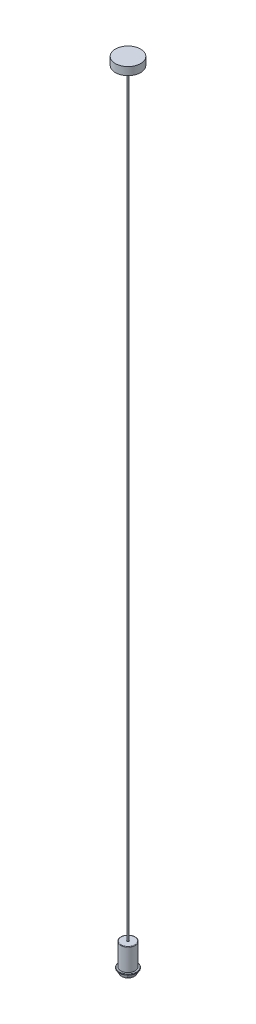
from build123d import *

# Parameters (mm, degrees)
CROQUIS1_R              = 23
SALIENTE_EXTRUIR1_DEPTH = 71
REDONDEO1_R             = 1.5
CROQUIS2_R              = 3.5
CORTAR_EXTRUIR1_DEPTH   = 1.5
CROQUIS3_R              = 2.5
CORTAR_EXTRUIR2_DEPTH   = 3
CROQUIS4_R              = 2
SALIENTE_EXTRUIR2_DEPTH = 2400
CROQUIS5_R              = 6.5
SALIENTE_EXTRUIR3_DEPTH = 10
CROQUIS6_R              = 40
SALIENTE_EXTRUIR4_DEPTH = 25
CROQUIS7_R              = 22.5
CORTAR_EXTRUIR3_DEPTH   = 35
CROQUIS8_R              = 20
SALIENTE_EXTRUIR5_DEPTH = 52
CROQUIS9_R              = 28
SALIENTE_EXTRUIR6_DEPTH = 3.5
REDONDEO2_R             = 1
CROQUIS10_R             = 23
CROQUIS10_R_2           = 20
SALIENTE_EXTRUIR7_DEPTH = 8
CORTAR_EXTRUIR4_START   = -3.5
CROQUIS11_R             = 20
CORTAR_EXTRUIR4_DEPTH   = 3.5
CROQUIS12_R             = 19
CORTAR_EXTRUIR5_DEPTH   = 58


with BuildPart() as part:
    # Croquis1 → Saliente-Extruir1 (new body)
    with BuildSketch(Plane(origin=(0, 0, 0), x_dir=(1, 0, 0), z_dir=(0, 1, 0))):
        with Locations(Location((0, 0, 0), (0, 0, 270))):
            Circle(CROQUIS1_R)
    extrude(amount=SALIENTE_EXTRUIR1_DEPTH)

    # Redondeo1
    redondeo1_edges = [part.edges().sort_by_distance(p)[0] for p in [
        (0, 71, -23),
    ]]
    fillet(redondeo1_edges, radius=REDONDEO1_R)

    # Croquis2 → Cortar-Extruir1 (cut)
    with BuildSketch(Plane(origin=(0, 71, 0), x_dir=(1, 0, 0), z_dir=(0, 1, 0))):
        with Locations(Location((0, 0, 0), (0, 0, 270))):
            Circle(CROQUIS2_R)
    extrude(amount=-CORTAR_EXTRUIR1_DEPTH, mode=Mode.SUBTRACT)

    # Croquis3 → Cortar-Extruir2 (cut)
    with BuildSketch(Plane(origin=(0, 69.5, 0), x_dir=(1, 0, 0), z_dir=(0, 1, 0))):
        with Locations(Location((0, 0, 0), (0, 0, 270))):
            Circle(CROQUIS3_R)
    extrude(amount=-CORTAR_EXTRUIR2_DEPTH, mode=Mode.SUBTRACT)

    # Croquis4 → Saliente-Extruir2 (add)
    with BuildSketch(Plane(origin=(0, 66.5, 0), x_dir=(1, 0, 0), z_dir=(0, 1, 0))):
        with Locations(Location((0, 0, 0), (0, 0, 270))):
            Circle(CROQUIS4_R)
    extrude(amount=SALIENTE_EXTRUIR2_DEPTH)

    # Croquis5 → Saliente-Extruir3 (add)
    with BuildSketch(Plane(origin=(0, 2466.5, 0), x_dir=(1, 0, 0), z_dir=(0, 1, 0))):
        with Locations(Location((0, 0, 0), (0, 0, 270))):
            Circle(CROQUIS5_R)
    extrude(amount=SALIENTE_EXTRUIR3_DEPTH)

    # Croquis6 → Saliente-Extruir4 (add)
    with BuildSketch(Plane(origin=(0, 2476.5, 0), x_dir=(1, 0, 0), z_dir=(0, 1, 0))):
        with Locations(Location((0, 0, 0), (0, 0, 270))):
            Circle(CROQUIS6_R)
    extrude(amount=SALIENTE_EXTRUIR4_DEPTH)

    # Croquis7 → Cortar-Extruir3 (cut)
    with BuildSketch(Plane.XZ):
        with Locations(Location((0, 0, 0), (0, 0, 270))):
            Circle(CROQUIS7_R)
    extrude(amount=-CORTAR_EXTRUIR3_DEPTH, mode=Mode.SUBTRACT)

    # Croquis8 → Saliente-Extruir5 (add)
    with BuildSketch(Plane.XZ.offset(-35)):
        with Locations(Location((0, 0, 0), (0, 0, 90))):
            Circle(CROQUIS8_R)
    extrude(amount=SALIENTE_EXTRUIR5_DEPTH)

    # Croquis12 → Cortar-Extruir5 (cut)
    with BuildSketch(Plane.XZ.offset(17)):
        with Locations(Location((0, 0, 0), (0, 0, 270))):
            Circle(CROQUIS12_R)
    extrude(amount=-CORTAR_EXTRUIR5_DEPTH, mode=Mode.SUBTRACT)


with BuildPart() as body_2:
    # Croquis9 → Saliente-Extruir6 (new body)
    with BuildSketch(Plane(origin=(0, -0.8, 0), x_dir=(-1, 0, 0), z_dir=(0, -1, 0))):
        with Locations(Location((0, 0, 0), (0, 0, 90))):
            Circle(CROQUIS9_R)
    extrude(amount=SALIENTE_EXTRUIR6_DEPTH)

    # Redondeo2
    redondeo2_edges = [body_2.edges().sort_by_distance(p)[0] for p in [
        (0, -0.8, 28),
        (0, -4.3, 28),
    ]]
    fillet(redondeo2_edges, radius=REDONDEO2_R)

    # Croquis10 → Saliente-Extruir7 (add)
    with BuildSketch(Plane.XZ.offset(4.3)):
        with Locations(Location((0, 0, 0), (0, 0, 270))):
            Circle(CROQUIS10_R)
        with Locations(Location((0, 0, 0), (0, 0, 270))):
            Circle(CROQUIS10_R_2, mode=Mode.SUBTRACT)
    extrude(amount=SALIENTE_EXTRUIR7_DEPTH)

    # Croquis11 → Cortar-Extruir4 (cut)
    with BuildSketch(Plane.XZ.offset(4.3).offset(CORTAR_EXTRUIR4_START)):
        with Locations(Location((0, 0, 0), (0, 0, 270))):
            Circle(CROQUIS11_R)
    extrude(amount=CORTAR_EXTRUIR4_DEPTH, mode=Mode.SUBTRACT)


solid = Compound([part.part, body_2.part])
